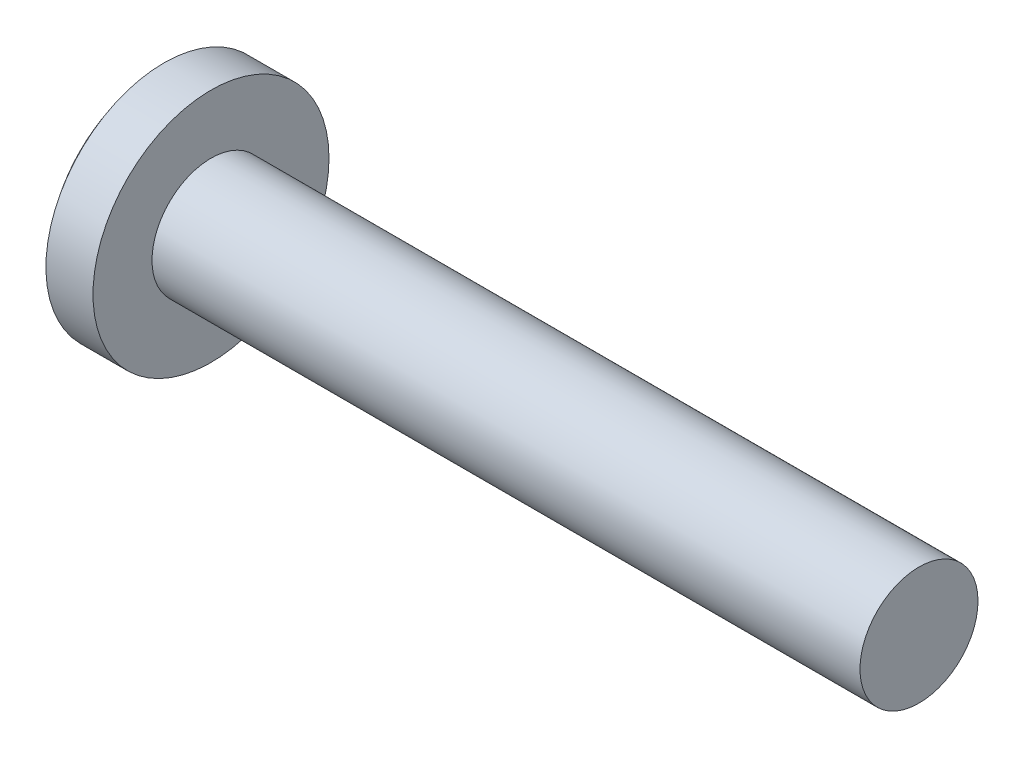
ISO-10303-21;
HEADER;
FILE_DESCRIPTION(('STEP AP214'),'2;1');
FILE_NAME('part.step','',(''),(''),'','','');
FILE_SCHEMA(('AUTOMOTIVE_DESIGN { 1 0 10303 214 1 1 1 1 }'));
ENDSEC;
DATA;
#1=APPLICATION_CONTEXT('core data for automotive mechanical design processes');
#2=APPLICATION_PROTOCOL_DEFINITION('international standard','automotive_design',2000,#1);
#3=PRODUCT_CONTEXT('',#1,'mechanical');
#4=PRODUCT('Part','Part','',(#3));
#5=PRODUCT_RELATED_PRODUCT_CATEGORY('part','',(#4));
#6=PRODUCT_DEFINITION_FORMATION('','',#4);
#7=PRODUCT_DEFINITION_CONTEXT('part definition',#1,'design');
#8=PRODUCT_DEFINITION('design','',#6,#7);
#9=PRODUCT_DEFINITION_SHAPE('','',#8);
#10=(LENGTH_UNIT() NAMED_UNIT(*) SI_UNIT(.MILLI.,.METRE.));
#11=(NAMED_UNIT(*) PLANE_ANGLE_UNIT() SI_UNIT($,.RADIAN.));
#12=(NAMED_UNIT(*) SI_UNIT($,.STERADIAN.) SOLID_ANGLE_UNIT());
#13=UNCERTAINTY_MEASURE_WITH_UNIT(LENGTH_MEASURE(1.E-05),#10,'distance_accuracy_value','');
#14=(GEOMETRIC_REPRESENTATION_CONTEXT(3) GLOBAL_UNCERTAINTY_ASSIGNED_CONTEXT((#13)) GLOBAL_UNIT_ASSIGNED_CONTEXT((#10,
#11,#12)) REPRESENTATION_CONTEXT('',''));
#15=CARTESIAN_POINT('',(0.,0.,0.));
#16=DIRECTION('',(0.,0.,1.));
#17=DIRECTION('',(1.,0.,0.));
#18=AXIS2_PLACEMENT_3D('',#15,#16,#17);
#19=CARTESIAN_POINT('',(16.,0.,0.));
#20=DIRECTION('',(1.,0.,0.));
#21=DIRECTION('',(0.,1.,0.));
#22=AXIS2_PLACEMENT_3D('',#19,#20,#21);
#23=SPHERICAL_SURFACE('',#22,16.);
#24=CARTESIAN_POINT('',(3.51000400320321,0.,0.));
#25=DIRECTION('',(1.,0.,0.));
#26=DIRECTION('',(0.,0.,-1.));
#27=AXIS2_PLACEMENT_3D('',#24,#25,#26);
#28=CIRCLE('',#27,10.);
#29=CARTESIAN_POINT('',(3.51000400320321,0.,-10.));
#30=VERTEX_POINT('',#29);
#31=EDGE_CURVE('E139',#30,#30,#28,.T.);
#32=ORIENTED_EDGE('',*,*,#31,.F.);
#33=EDGE_LOOP('',(#32));
#34=FACE_BOUND('',#33,.T.);
#35=CARTESIAN_POINT('',(16.,-1.01,0.));
#36=DIRECTION('',(0.,1.,0.));
#37=DIRECTION('',(0.,0.,1.));
#38=AXIS2_PLACEMENT_3D('',#35,#36,#37);
#39=CIRCLE('',#38,15.9680900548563);
#40=CARTESIAN_POINT('',(0.719312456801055,-1.01,4.63470475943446));
#41=VERTEX_POINT('',#40);
#42=CARTESIAN_POINT('',(0.0857359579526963,-1.01,1.31));
#43=VERTEX_POINT('',#42);
#44=EDGE_CURVE('E223',#41,#43,#39,.F.);
#45=ORIENTED_EDGE('',*,*,#44,.T.);
#46=CARTESIAN_POINT('',(0.0857359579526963,-1.01,1.31));
#47=CARTESIAN_POINT('',(0.0843523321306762,-1.009985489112,1.29320579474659));
#48=CARTESIAN_POINT('',(0.0830867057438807,-1.01140943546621,1.27640447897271));
#49=CARTESIAN_POINT('',(0.0808227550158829,-1.01703840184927,1.2432658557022));
#50=CARTESIAN_POINT('',(0.0798242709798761,-1.02124175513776,1.2269282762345));
#51=CARTESIAN_POINT('',(0.0781236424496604,-1.03233739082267,1.1951641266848));
#52=CARTESIAN_POINT('',(0.0774216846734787,-1.0392313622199,1.17973813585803));
#53=CARTESIAN_POINT('',(0.0763353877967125,-1.0555106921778,1.15025481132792));
#54=CARTESIAN_POINT('',(0.0759509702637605,-1.06489543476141,1.13619714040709));
#55=CARTESIAN_POINT('',(0.0755117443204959,-1.08585350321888,1.10989987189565));
#56=CARTESIAN_POINT('',(0.0754557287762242,-1.09741865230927,1.09765377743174));
#57=CARTESIAN_POINT('',(0.0756717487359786,-1.1224332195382,1.07526516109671));
#58=CARTESIAN_POINT('',(0.0759438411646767,-1.13588296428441,1.06512300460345));
#59=CARTESIAN_POINT('',(0.0768074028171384,-1.16425771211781,1.04724522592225));
#60=CARTESIAN_POINT('',(0.0773984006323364,-1.1791805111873,1.03950607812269));
#61=CARTESIAN_POINT('',(0.0788823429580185,-1.21009230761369,1.02663024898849));
#62=CARTESIAN_POINT('',(0.0797751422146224,-1.22608078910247,1.02149231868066));
#63=CARTESIAN_POINT('',(0.0815069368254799,-1.25346282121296,1.01515515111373));
#64=CARTESIAN_POINT('',(0.0822724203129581,-1.2646970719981,1.0132225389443));
#65=CARTESIAN_POINT('',(0.08391953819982,-1.28728760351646,1.01064499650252));
#66=CARTESIAN_POINT('',(0.084801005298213,-1.29864368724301,1.00999823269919));
#67=CARTESIAN_POINT('',(0.0857359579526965,-1.31,1.01));
#68=B_SPLINE_CURVE_WITH_KNOTS('',3,(#46,#47,#48,#49,#50,#51,#52,#53,#54,#55,#56,#57,#58,#59,#60,
#61,#62,#63,#64,#65,#66,#67),.UNSPECIFIED.,.F.,.F.,(4,2,2,2,2,2,2,2,2,2,4),(0.,
0.0504891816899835,0.100948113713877,0.151438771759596,0.20191695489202,0.252209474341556,
0.30251072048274,0.352737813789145,0.402940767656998,0.437146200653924,0.471302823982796),.UNSPECIFIED.);
#69=CARTESIAN_POINT('',(0.0857359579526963,-1.31,1.01));
#70=VERTEX_POINT('',#69);
#71=EDGE_CURVE('E226',#43,#70,#68,.T.);
#72=ORIENTED_EDGE('',*,*,#71,.T.);
#73=CARTESIAN_POINT('',(16.,0.,1.01));
#74=DIRECTION('',(0.,0.,-1.));
#75=DIRECTION('',(0.,1.,0.));
#76=AXIS2_PLACEMENT_3D('',#73,#74,#75);
#77=CIRCLE('',#76,15.9680900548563);
#78=CARTESIAN_POINT('',(0.719312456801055,-4.63470475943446,1.01));
#79=VERTEX_POINT('',#78);
#80=EDGE_CURVE('E235',#70,#79,#77,.F.);
#81=ORIENTED_EDGE('',*,*,#80,.T.);
#82=CARTESIAN_POINT('',(14.1867141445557,3.14070323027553,0.));
#83=DIRECTION('',(-0.500000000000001,0.866025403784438,0.));
#84=DIRECTION('',(-0.866025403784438,-0.500000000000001,0.));
#85=AXIS2_PLACEMENT_3D('',#82,#83,#84);
#86=CIRCLE('',#85,15.5835803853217);
#87=CARTESIAN_POINT('',(0.719312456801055,-4.63470475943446,-1.01));
#88=VERTEX_POINT('',#87);
#89=EDGE_CURVE('E238',#79,#88,#86,.F.);
#90=ORIENTED_EDGE('',*,*,#89,.T.);
#91=CARTESIAN_POINT('',(16.,0.,-1.01));
#92=DIRECTION('',(0.,0.,1.));
#93=DIRECTION('',(1.,0.,0.));
#94=AXIS2_PLACEMENT_3D('',#91,#92,#93);
#95=CIRCLE('',#94,15.9680900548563);
#96=CARTESIAN_POINT('',(0.0857359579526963,-1.31,-1.01));
#97=VERTEX_POINT('',#96);
#98=EDGE_CURVE('E244',#88,#97,#95,.F.);
#99=ORIENTED_EDGE('',*,*,#98,.T.);
#100=CARTESIAN_POINT('',(0.0857359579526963,-1.31,-1.01));
#101=CARTESIAN_POINT('',(0.0843523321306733,-1.29320579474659,-1.009985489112));
#102=CARTESIAN_POINT('',(0.083086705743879,-1.27640447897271,-1.01140943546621));
#103=CARTESIAN_POINT('',(0.0808227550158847,-1.2432658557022,-1.01703840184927));
#104=CARTESIAN_POINT('',(0.0798242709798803,-1.2269282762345,-1.02124175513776));
#105=CARTESIAN_POINT('',(0.0781236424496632,-1.1951641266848,-1.03233739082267));
#106=CARTESIAN_POINT('',(0.0774216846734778,-1.17973813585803,-1.0392313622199));
#107=CARTESIAN_POINT('',(0.0763353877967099,-1.15025481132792,-1.0555106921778));
#108=CARTESIAN_POINT('',(0.0759509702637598,-1.13619714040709,-1.06489543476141));
#109=CARTESIAN_POINT('',(0.0755117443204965,-1.10989987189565,-1.08585350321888));
#110=CARTESIAN_POINT('',(0.075455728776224,-1.09765377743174,-1.09741865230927));
#111=CARTESIAN_POINT('',(0.0756717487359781,-1.07526516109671,-1.1224332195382));
#112=CARTESIAN_POINT('',(0.0759438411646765,-1.06512300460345,-1.13588296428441));
#113=CARTESIAN_POINT('',(0.0768074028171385,-1.04724522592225,-1.16425771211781));
#114=CARTESIAN_POINT('',(0.0773984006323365,-1.03950607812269,-1.1791805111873));
#115=CARTESIAN_POINT('',(0.0788823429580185,-1.02663024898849,-1.21009230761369));
#116=CARTESIAN_POINT('',(0.0797751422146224,-1.02149231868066,-1.22608078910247));
#117=CARTESIAN_POINT('',(0.0815069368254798,-1.01515515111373,-1.25346282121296));
#118=CARTESIAN_POINT('',(0.0822724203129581,-1.0132225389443,-1.2646970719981));
#119=CARTESIAN_POINT('',(0.08391953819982,-1.01064499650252,-1.28728760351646));
#120=CARTESIAN_POINT('',(0.0848010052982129,-1.00999823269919,-1.29864368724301));
#121=CARTESIAN_POINT('',(0.0857359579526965,-1.01,-1.31));
#122=B_SPLINE_CURVE_WITH_KNOTS('',3,(#100,#101,#102,#103,#104,#105,#106,#107,#108,#109,#110,
#111,#112,#113,#114,#115,#116,#117,#118,#119,#120,#121),.UNSPECIFIED.,.F.,.F.,(4,2,2,2,2,2,2,2,
2,2,4),(0.,0.0504891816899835,0.100948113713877,0.151438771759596,0.20191695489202,
0.252209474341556,0.30251072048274,0.352737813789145,0.402940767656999,0.437146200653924,
0.471302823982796),.UNSPECIFIED.);
#123=CARTESIAN_POINT('',(0.0857359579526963,-1.01,-1.31));
#124=VERTEX_POINT('',#123);
#125=EDGE_CURVE('E345',#97,#124,#122,.T.);
#126=ORIENTED_EDGE('',*,*,#125,.T.);
#127=CARTESIAN_POINT('',(16.,-1.01,0.));
#128=DIRECTION('',(0.,1.,0.));
#129=DIRECTION('',(0.,0.,1.));
#130=AXIS2_PLACEMENT_3D('',#127,#128,#129);
#131=CIRCLE('',#130,15.9680900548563);
#132=CARTESIAN_POINT('',(0.719312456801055,-1.01,-4.63470475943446));
#133=VERTEX_POINT('',#132);
#134=EDGE_CURVE('E242',#124,#133,#131,.F.);
#135=ORIENTED_EDGE('',*,*,#134,.T.);
#136=CARTESIAN_POINT('',(14.1867141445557,0.,3.14070323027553));
#137=DIRECTION('',(-0.500000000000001,0.,0.866025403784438));
#138=DIRECTION('',(0.866025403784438,0.,0.500000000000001));
#139=AXIS2_PLACEMENT_3D('',#136,#137,#138);
#140=CIRCLE('',#139,15.5835803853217);
#141=CARTESIAN_POINT('',(0.719312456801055,1.01,-4.63470475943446));
#142=VERTEX_POINT('',#141);
#143=EDGE_CURVE('E245',#133,#142,#140,.F.);
#144=ORIENTED_EDGE('',*,*,#143,.T.);
#145=CARTESIAN_POINT('',(16.,1.01,0.));
#146=DIRECTION('',(0.,-1.,0.));
#147=DIRECTION('',(0.,0.,-1.));
#148=AXIS2_PLACEMENT_3D('',#145,#146,#147);
#149=CIRCLE('',#148,15.9680900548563);
#150=CARTESIAN_POINT('',(0.0857359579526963,1.01,-1.31));
#151=VERTEX_POINT('',#150);
#152=EDGE_CURVE('E246',#142,#151,#149,.F.);
#153=ORIENTED_EDGE('',*,*,#152,.T.);
#154=CARTESIAN_POINT('',(0.0857359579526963,1.01,-1.31));
#155=CARTESIAN_POINT('',(0.0843523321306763,1.009985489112,-1.29320579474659));
#156=CARTESIAN_POINT('',(0.0830867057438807,1.01140943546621,-1.27640447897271));
#157=CARTESIAN_POINT('',(0.0808227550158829,1.01703840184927,-1.2432658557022));
#158=CARTESIAN_POINT('',(0.0798242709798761,1.02124175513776,-1.2269282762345));
#159=CARTESIAN_POINT('',(0.0781236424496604,1.03233739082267,-1.1951641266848));
#160=CARTESIAN_POINT('',(0.0774216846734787,1.0392313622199,-1.17973813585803));
#161=CARTESIAN_POINT('',(0.0763353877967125,1.0555106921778,-1.15025481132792));
#162=CARTESIAN_POINT('',(0.0759509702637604,1.06489543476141,-1.13619714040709));
#163=CARTESIAN_POINT('',(0.0755117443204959,1.08585350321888,-1.10989987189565));
#164=CARTESIAN_POINT('',(0.0754557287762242,1.09741865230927,-1.09765377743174));
#165=CARTESIAN_POINT('',(0.0756717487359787,1.1224332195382,-1.07526516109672));
#166=CARTESIAN_POINT('',(0.0759438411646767,1.13588296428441,-1.06512300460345));
#167=CARTESIAN_POINT('',(0.0768074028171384,1.16425771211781,-1.04724522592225));
#168=CARTESIAN_POINT('',(0.0773984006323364,1.1791805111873,-1.03950607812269));
#169=CARTESIAN_POINT('',(0.0788823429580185,1.21009230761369,-1.02663024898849));
#170=CARTESIAN_POINT('',(0.0797751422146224,1.22608078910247,-1.02149231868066));
#171=CARTESIAN_POINT('',(0.0815069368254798,1.25346282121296,-1.01515515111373));
#172=CARTESIAN_POINT('',(0.0822724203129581,1.2646970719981,-1.0132225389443));
#173=CARTESIAN_POINT('',(0.08391953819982,1.28728760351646,-1.01064499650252));
#174=CARTESIAN_POINT('',(0.084801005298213,1.29864368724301,-1.00999823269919));
#175=CARTESIAN_POINT('',(0.0857359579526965,1.31,-1.01));
#176=B_SPLINE_CURVE_WITH_KNOTS('',3,(#154,#155,#156,#157,#158,#159,#160,#161,#162,#163,#164,
#165,#166,#167,#168,#169,#170,#171,#172,#173,#174,#175),.UNSPECIFIED.,.F.,.F.,(4,2,2,2,2,2,2,2,
2,2,4),(0.,0.0504891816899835,0.100948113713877,0.151438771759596,0.20191695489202,
0.252209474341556,0.30251072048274,0.352737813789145,0.402940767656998,0.437146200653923,
0.471302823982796),.UNSPECIFIED.);
#177=CARTESIAN_POINT('',(0.0857359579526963,1.31,-1.01));
#178=VERTEX_POINT('',#177);
#179=EDGE_CURVE('E157',#151,#178,#176,.T.);
#180=ORIENTED_EDGE('',*,*,#179,.T.);
#181=CARTESIAN_POINT('',(16.,0.,-1.01));
#182=DIRECTION('',(0.,0.,1.));
#183=DIRECTION('',(1.,0.,0.));
#184=AXIS2_PLACEMENT_3D('',#181,#182,#183);
#185=CIRCLE('',#184,15.9680900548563);
#186=CARTESIAN_POINT('',(0.719312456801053,4.63470475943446,-1.01));
#187=VERTEX_POINT('',#186);
#188=EDGE_CURVE('E248',#178,#187,#185,.F.);
#189=ORIENTED_EDGE('',*,*,#188,.T.);
#190=CARTESIAN_POINT('',(14.1867141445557,-3.14070323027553,0.));
#191=DIRECTION('',(-0.500000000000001,-0.866025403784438,0.));
#192=DIRECTION('',(0.866025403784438,-0.500000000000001,0.));
#193=AXIS2_PLACEMENT_3D('',#190,#191,#192);
#194=CIRCLE('',#193,15.5835803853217);
#195=CARTESIAN_POINT('',(0.719312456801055,4.63470475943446,1.01));
#196=VERTEX_POINT('',#195);
#197=EDGE_CURVE('E122',#187,#196,#194,.F.);
#198=ORIENTED_EDGE('',*,*,#197,.T.);
#199=CARTESIAN_POINT('',(16.,0.,1.01));
#200=DIRECTION('',(0.,0.,-1.));
#201=DIRECTION('',(0.,1.,0.));
#202=AXIS2_PLACEMENT_3D('',#199,#200,#201);
#203=CIRCLE('',#202,15.9680900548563);
#204=CARTESIAN_POINT('',(0.0857359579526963,1.31,1.01));
#205=VERTEX_POINT('',#204);
#206=EDGE_CURVE('E153',#196,#205,#203,.F.);
#207=ORIENTED_EDGE('',*,*,#206,.T.);
#208=CARTESIAN_POINT('',(0.0857359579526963,1.31,1.01));
#209=CARTESIAN_POINT('',(0.0843523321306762,1.29320579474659,1.009985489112));
#210=CARTESIAN_POINT('',(0.0830867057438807,1.27640447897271,1.01140943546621));
#211=CARTESIAN_POINT('',(0.0808227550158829,1.2432658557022,1.01703840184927));
#212=CARTESIAN_POINT('',(0.0798242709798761,1.2269282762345,1.02124175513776));
#213=CARTESIAN_POINT('',(0.0781236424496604,1.1951641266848,1.03233739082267));
#214=CARTESIAN_POINT('',(0.0774216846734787,1.17973813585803,1.0392313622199));
#215=CARTESIAN_POINT('',(0.0763353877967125,1.15025481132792,1.0555106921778));
#216=CARTESIAN_POINT('',(0.0759509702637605,1.13619714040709,1.06489543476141));
#217=CARTESIAN_POINT('',(0.075511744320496,1.10989987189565,1.08585350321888));
#218=CARTESIAN_POINT('',(0.0754557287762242,1.09765377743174,1.09741865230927));
#219=CARTESIAN_POINT('',(0.0756717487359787,1.07526516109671,1.1224332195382));
#220=CARTESIAN_POINT('',(0.0759438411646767,1.06512300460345,1.13588296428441));
#221=CARTESIAN_POINT('',(0.0768074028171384,1.04724522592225,1.16425771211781));
#222=CARTESIAN_POINT('',(0.0773984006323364,1.03950607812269,1.1791805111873));
#223=CARTESIAN_POINT('',(0.0788823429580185,1.02663024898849,1.21009230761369));
#224=CARTESIAN_POINT('',(0.0797751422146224,1.02149231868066,1.22608078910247));
#225=CARTESIAN_POINT('',(0.0815069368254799,1.01515515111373,1.25346282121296));
#226=CARTESIAN_POINT('',(0.0822724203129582,1.0132225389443,1.2646970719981));
#227=CARTESIAN_POINT('',(0.0839195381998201,1.01064499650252,1.28728760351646));
#228=CARTESIAN_POINT('',(0.084801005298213,1.00999823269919,1.29864368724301));
#229=CARTESIAN_POINT('',(0.0857359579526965,1.01,1.31));
#230=B_SPLINE_CURVE_WITH_KNOTS('',3,(#208,#209,#210,#211,#212,#213,#214,#215,#216,#217,#218,
#219,#220,#221,#222,#223,#224,#225,#226,#227,#228,#229),.UNSPECIFIED.,.F.,.F.,(4,2,2,2,2,2,2,2,
2,2,4),(0.,0.0504891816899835,0.100948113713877,0.151438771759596,0.20191695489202,
0.252209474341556,0.30251072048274,0.352737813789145,0.402940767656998,0.437146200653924,
0.471302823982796),.UNSPECIFIED.);
#231=CARTESIAN_POINT('',(0.0857359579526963,1.01,1.31));
#232=VERTEX_POINT('',#231);
#233=EDGE_CURVE('E167',#205,#232,#230,.T.);
#234=ORIENTED_EDGE('',*,*,#233,.T.);
#235=CARTESIAN_POINT('',(16.,1.01,0.));
#236=DIRECTION('',(0.,-1.,0.));
#237=DIRECTION('',(0.,0.,-1.));
#238=AXIS2_PLACEMENT_3D('',#235,#236,#237);
#239=CIRCLE('',#238,15.9680900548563);
#240=CARTESIAN_POINT('',(0.719312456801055,1.01,4.63470475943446));
#241=VERTEX_POINT('',#240);
#242=EDGE_CURVE('E158',#232,#241,#239,.F.);
#243=ORIENTED_EDGE('',*,*,#242,.T.);
#244=CARTESIAN_POINT('',(14.1867141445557,0.,-3.14070323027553));
#245=DIRECTION('',(-0.500000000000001,0.,-0.866025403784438));
#246=DIRECTION('',(-0.866025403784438,0.,0.500000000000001));
#247=AXIS2_PLACEMENT_3D('',#244,#245,#246);
#248=CIRCLE('',#247,15.5835803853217);
#249=EDGE_CURVE('E229',#241,#41,#248,.F.);
#250=ORIENTED_EDGE('',*,*,#249,.T.);
#251=EDGE_LOOP('',(#45,#72,#81,#90,#99,#126,#135,#144,#153,#180,#189,#198,#207,#234,#243,#250));
#252=FACE_BOUND('',#251,.T.);
#253=ADVANCED_FACE('F37',(#34,#252),#23,.T.);
#254=CARTESIAN_POINT('',(67.5,5.00000000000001,0.));
#255=DIRECTION('',(1.,0.,0.));
#256=DIRECTION('',(0.,0.,-1.));
#257=AXIS2_PLACEMENT_3D('',#254,#255,#256);
#258=PLANE('',#257);
#259=CARTESIAN_POINT('',(67.5,0.,0.));
#260=DIRECTION('',(1.,0.,0.));
#261=DIRECTION('',(0.,0.,-1.));
#262=AXIS2_PLACEMENT_3D('',#259,#260,#261);
#263=CIRCLE('',#262,5.00000000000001);
#264=CARTESIAN_POINT('',(67.5,0.,-5.00000000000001));
#265=VERTEX_POINT('',#264);
#266=EDGE_CURVE('E150',#265,#265,#263,.T.);
#267=ORIENTED_EDGE('',*,*,#266,.T.);
#268=EDGE_LOOP('',(#267));
#269=FACE_BOUND('',#268,.T.);
#270=ADVANCED_FACE('F209',(#269),#258,.T.);
#271=CARTESIAN_POINT('',(4.51581291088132,0.,0.));
#272=DIRECTION('',(1.,0.,0.));
#273=DIRECTION('',(0.,0.,-1.));
#274=AXIS2_PLACEMENT_3D('',#271,#272,#273);
#275=CYLINDRICAL_SURFACE('',#274,5.);
#276=CARTESIAN_POINT('',(7.50000000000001,0.,0.));
#277=DIRECTION('',(1.,0.,0.));
#278=DIRECTION('',(0.,0.,-1.));
#279=AXIS2_PLACEMENT_3D('',#276,#277,#278);
#280=CIRCLE('',#279,5.);
#281=CARTESIAN_POINT('',(7.50000000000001,0.,-5.));
#282=VERTEX_POINT('',#281);
#283=EDGE_CURVE('E147',#282,#282,#280,.T.);
#284=ORIENTED_EDGE('',*,*,#283,.T.);
#285=EDGE_LOOP('',(#284));
#286=FACE_BOUND('',#285,.T.);
#287=ORIENTED_EDGE('',*,*,#266,.F.);
#288=EDGE_LOOP('',(#287));
#289=FACE_BOUND('',#288,.T.);
#290=ADVANCED_FACE('F214',(#286,#289),#275,.T.);
#291=CARTESIAN_POINT('',(7.50000000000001,5.6,0.));
#292=DIRECTION('',(1.,0.,0.));
#293=DIRECTION('',(0.,0.,-1.));
#294=AXIS2_PLACEMENT_3D('',#291,#292,#293);
#295=PLANE('',#294);
#296=CARTESIAN_POINT('',(7.50000000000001,0.,0.));
#297=DIRECTION('',(1.,0.,0.));
#298=DIRECTION('',(0.,0.,-1.));
#299=AXIS2_PLACEMENT_3D('',#296,#297,#298);
#300=CIRCLE('',#299,10.);
#301=CARTESIAN_POINT('',(7.50000000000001,0.,-10.));
#302=VERTEX_POINT('',#301);
#303=EDGE_CURVE('E142',#302,#302,#300,.T.);
#304=ORIENTED_EDGE('',*,*,#303,.T.);
#305=EDGE_LOOP('',(#304));
#306=FACE_BOUND('',#305,.T.);
#307=ORIENTED_EDGE('',*,*,#283,.F.);
#308=EDGE_LOOP('',(#307));
#309=FACE_BOUND('',#308,.T.);
#310=ADVANCED_FACE('F413',(#306,#309),#295,.T.);
#311=CARTESIAN_POINT('',(4.51581291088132,0.,0.));
#312=DIRECTION('',(1.,0.,0.));
#313=DIRECTION('',(0.,0.,-1.));
#314=AXIS2_PLACEMENT_3D('',#311,#312,#313);
#315=CYLINDRICAL_SURFACE('',#314,10.);
#316=ORIENTED_EDGE('',*,*,#31,.T.);
#317=EDGE_LOOP('',(#316));
#318=FACE_BOUND('',#317,.T.);
#319=ORIENTED_EDGE('',*,*,#303,.F.);
#320=EDGE_LOOP('',(#319));
#321=FACE_BOUND('',#320,.T.);
#322=ADVANCED_FACE('F409',(#318,#321),#315,.T.);
#323=CARTESIAN_POINT('',(1.3,1.01,1.01));
#324=DIRECTION('',(0.,-1.,0.));
#325=DIRECTION('',(0.,0.,-1.));
#326=AXIS2_PLACEMENT_3D('',#323,#324,#325);
#327=PLANE('',#326);
#328=ORIENTED_EDGE('',*,*,#242,.F.);
#329=DIRECTION('',(-1.,0.,0.));
#330=VECTOR('',#329,1.);
#331=CARTESIAN_POINT('',(1.3,1.01,1.31));
#332=LINE('',#331,#330);
#333=CARTESIAN_POINT('',(1.3,1.01,1.31));
#334=VERTEX_POINT('',#333);
#335=EDGE_CURVE('E299',#232,#334,#332,.F.);
#336=ORIENTED_EDGE('',*,*,#335,.T.);
#337=DIRECTION('',(0.,0.,1.));
#338=VECTOR('',#337,1.);
#339=CARTESIAN_POINT('',(1.3,1.01,1.01));
#340=LINE('',#339,#338);
#341=CARTESIAN_POINT('',(1.3,1.01,4.29944465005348));
#342=VERTEX_POINT('',#341);
#343=EDGE_CURVE('E263',#334,#342,#340,.T.);
#344=ORIENTED_EDGE('',*,*,#343,.T.);
#345=DIRECTION('',(-0.866025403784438,0.,0.500000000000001));
#346=VECTOR('',#345,1.);
#347=CARTESIAN_POINT('',(0.,1.01,5.05));
#348=LINE('',#347,#346);
#349=EDGE_CURVE('E143',#342,#241,#348,.T.);
#350=ORIENTED_EDGE('',*,*,#349,.T.);
#351=EDGE_LOOP('',(#328,#336,#344,#350));
#352=FACE_BOUND('',#351,.T.);
#353=ADVANCED_FACE('F189',(#352),#327,.T.);
#354=CARTESIAN_POINT('',(0.,0.,5.05));
#355=DIRECTION('',(-0.500000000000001,0.,-0.866025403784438));
#356=DIRECTION('',(-0.866025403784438,0.,0.500000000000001));
#357=AXIS2_PLACEMENT_3D('',#354,#355,#356);
#358=PLANE('',#357);
#359=ORIENTED_EDGE('',*,*,#349,.F.);
#360=DIRECTION('',(0.,-1.,0.));
#361=VECTOR('',#360,1.);
#362=CARTESIAN_POINT('',(1.3,0.,4.29944465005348));
#363=LINE('',#362,#361);
#364=CARTESIAN_POINT('',(1.3,-1.01,4.29944465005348));
#365=VERTEX_POINT('',#364);
#366=EDGE_CURVE('E260',#342,#365,#363,.T.);
#367=ORIENTED_EDGE('',*,*,#366,.T.);
#368=DIRECTION('',(-0.866025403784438,0.,0.500000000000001));
#369=VECTOR('',#368,1.);
#370=CARTESIAN_POINT('',(2.72437131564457,-1.01,3.47708348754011));
#371=LINE('',#370,#369);
#372=EDGE_CURVE('E256',#365,#41,#371,.T.);
#373=ORIENTED_EDGE('',*,*,#372,.T.);
#374=ORIENTED_EDGE('',*,*,#249,.F.);
#375=EDGE_LOOP('',(#359,#367,#373,#374));
#376=FACE_BOUND('',#375,.T.);
#377=ADVANCED_FACE('F185',(#376),#358,.T.);
#378=CARTESIAN_POINT('',(1.3,-1.01,1.01));
#379=DIRECTION('',(0.,1.,0.));
#380=DIRECTION('',(0.,0.,1.));
#381=AXIS2_PLACEMENT_3D('',#378,#379,#380);
#382=PLANE('',#381);
#383=DIRECTION('',(0.,0.,-1.));
#384=VECTOR('',#383,1.);
#385=CARTESIAN_POINT('',(1.3,-1.01,1.01));
#386=LINE('',#385,#384);
#387=CARTESIAN_POINT('',(1.3,-1.01,1.31));
#388=VERTEX_POINT('',#387);
#389=EDGE_CURVE('E262',#365,#388,#386,.T.);
#390=ORIENTED_EDGE('',*,*,#389,.T.);
#391=DIRECTION('',(-1.,0.,0.));
#392=VECTOR('',#391,1.);
#393=CARTESIAN_POINT('',(1.3,-1.01,1.31));
#394=LINE('',#393,#392);
#395=EDGE_CURVE('E154',#388,#43,#394,.T.);
#396=ORIENTED_EDGE('',*,*,#395,.T.);
#397=ORIENTED_EDGE('',*,*,#44,.F.);
#398=ORIENTED_EDGE('',*,*,#372,.F.);
#399=EDGE_LOOP('',(#390,#396,#397,#398));
#400=FACE_BOUND('',#399,.T.);
#401=ADVANCED_FACE('F188',(#400),#382,.T.);
#402=CARTESIAN_POINT('',(1.3,-1.01,1.01));
#403=DIRECTION('',(0.,0.,-1.));
#404=DIRECTION('',(0.,1.,0.));
#405=AXIS2_PLACEMENT_3D('',#402,#403,#404);
#406=PLANE('',#405);
#407=ORIENTED_EDGE('',*,*,#80,.F.);
#408=DIRECTION('',(-1.,0.,0.));
#409=VECTOR('',#408,1.);
#410=CARTESIAN_POINT('',(1.3,-1.31,1.01));
#411=LINE('',#410,#409);
#412=CARTESIAN_POINT('',(1.3,-1.31,1.01));
#413=VERTEX_POINT('',#412);
#414=EDGE_CURVE('E344',#70,#413,#411,.F.);
#415=ORIENTED_EDGE('',*,*,#414,.T.);
#416=DIRECTION('',(0.,-1.,0.));
#417=VECTOR('',#416,1.);
#418=CARTESIAN_POINT('',(1.3,-1.01,1.01));
#419=LINE('',#418,#417);
#420=CARTESIAN_POINT('',(1.3,-4.29944465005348,1.01));
#421=VERTEX_POINT('',#420);
#422=EDGE_CURVE('E283',#413,#421,#419,.T.);
#423=ORIENTED_EDGE('',*,*,#422,.T.);
#424=DIRECTION('',(-0.866025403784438,-0.500000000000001,0.));
#425=VECTOR('',#424,1.);
#426=CARTESIAN_POINT('',(0.,-5.05,1.01));
#427=LINE('',#426,#425);
#428=EDGE_CURVE('E259',#421,#79,#427,.T.);
#429=ORIENTED_EDGE('',*,*,#428,.T.);
#430=EDGE_LOOP('',(#407,#415,#423,#429));
#431=FACE_BOUND('',#430,.T.);
#432=ADVANCED_FACE('F196',(#431),#406,.T.);
#433=CARTESIAN_POINT('',(0.,-5.05,0.));
#434=DIRECTION('',(-0.500000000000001,0.866025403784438,0.));
#435=DIRECTION('',(-0.866025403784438,-0.500000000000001,0.));
#436=AXIS2_PLACEMENT_3D('',#433,#434,#435);
#437=PLANE('',#436);
#438=ORIENTED_EDGE('',*,*,#428,.F.);
#439=DIRECTION('',(0.,0.,-1.));
#440=VECTOR('',#439,1.);
#441=CARTESIAN_POINT('',(1.3,-4.29944465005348,0.));
#442=LINE('',#441,#440);
#443=CARTESIAN_POINT('',(1.3,-4.29944465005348,-1.01));
#444=VERTEX_POINT('',#443);
#445=EDGE_CURVE('E281',#421,#444,#442,.T.);
#446=ORIENTED_EDGE('',*,*,#445,.T.);
#447=DIRECTION('',(-0.866025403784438,-0.500000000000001,0.));
#448=VECTOR('',#447,1.);
#449=CARTESIAN_POINT('',(2.72437131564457,-3.47708348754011,-1.01));
#450=LINE('',#449,#448);
#451=EDGE_CURVE('E267',#444,#88,#450,.T.);
#452=ORIENTED_EDGE('',*,*,#451,.T.);
#453=ORIENTED_EDGE('',*,*,#89,.F.);
#454=EDGE_LOOP('',(#438,#446,#452,#453));
#455=FACE_BOUND('',#454,.T.);
#456=ADVANCED_FACE('F193',(#455),#437,.T.);
#457=CARTESIAN_POINT('',(1.3,-1.01,-1.01));
#458=DIRECTION('',(0.,0.,1.));
#459=DIRECTION('',(1.,0.,0.));
#460=AXIS2_PLACEMENT_3D('',#457,#458,#459);
#461=PLANE('',#460);
#462=DIRECTION('',(0.,1.,0.));
#463=VECTOR('',#462,1.);
#464=CARTESIAN_POINT('',(1.3,-1.01,-1.01));
#465=LINE('',#464,#463);
#466=CARTESIAN_POINT('',(1.3,-1.31,-1.01));
#467=VERTEX_POINT('',#466);
#468=EDGE_CURVE('E282',#444,#467,#465,.T.);
#469=ORIENTED_EDGE('',*,*,#468,.T.);
#470=DIRECTION('',(-1.,0.,0.));
#471=VECTOR('',#470,1.);
#472=CARTESIAN_POINT('',(1.3,-1.31,-1.01));
#473=LINE('',#472,#471);
#474=EDGE_CURVE('E347',#467,#97,#473,.T.);
#475=ORIENTED_EDGE('',*,*,#474,.T.);
#476=ORIENTED_EDGE('',*,*,#98,.F.);
#477=ORIENTED_EDGE('',*,*,#451,.F.);
#478=EDGE_LOOP('',(#469,#475,#476,#477));
#479=FACE_BOUND('',#478,.T.);
#480=ADVANCED_FACE('F195',(#479),#461,.T.);
#481=CARTESIAN_POINT('',(1.3,-1.01,-1.01));
#482=DIRECTION('',(0.,1.,0.));
#483=DIRECTION('',(0.,0.,1.));
#484=AXIS2_PLACEMENT_3D('',#481,#482,#483);
#485=PLANE('',#484);
#486=ORIENTED_EDGE('',*,*,#134,.F.);
#487=DIRECTION('',(-1.,0.,0.));
#488=VECTOR('',#487,1.);
#489=CARTESIAN_POINT('',(1.3,-1.01,-1.31));
#490=LINE('',#489,#488);
#491=CARTESIAN_POINT('',(1.3,-1.01,-1.31));
#492=VERTEX_POINT('',#491);
#493=EDGE_CURVE('E372',#124,#492,#490,.F.);
#494=ORIENTED_EDGE('',*,*,#493,.T.);
#495=DIRECTION('',(0.,0.,-1.));
#496=VECTOR('',#495,1.);
#497=CARTESIAN_POINT('',(1.3,-1.01,-1.01));
#498=LINE('',#497,#496);
#499=CARTESIAN_POINT('',(1.3,-1.01,-4.29944465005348));
#500=VERTEX_POINT('',#499);
#501=EDGE_CURVE('E274',#492,#500,#498,.T.);
#502=ORIENTED_EDGE('',*,*,#501,.T.);
#503=DIRECTION('',(-0.866025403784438,0.,-0.500000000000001));
#504=VECTOR('',#503,1.);
#505=CARTESIAN_POINT('',(0.,-1.01,-5.05));
#506=LINE('',#505,#504);
#507=EDGE_CURVE('E264',#500,#133,#506,.T.);
#508=ORIENTED_EDGE('',*,*,#507,.T.);
#509=EDGE_LOOP('',(#486,#494,#502,#508));
#510=FACE_BOUND('',#509,.T.);
#511=ADVANCED_FACE('F202',(#510),#485,.T.);
#512=CARTESIAN_POINT('',(0.,0.,-5.05));
#513=DIRECTION('',(-0.500000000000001,0.,0.866025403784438));
#514=DIRECTION('',(0.866025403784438,0.,0.500000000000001));
#515=AXIS2_PLACEMENT_3D('',#512,#513,#514);
#516=PLANE('',#515);
#517=ORIENTED_EDGE('',*,*,#507,.F.);
#518=DIRECTION('',(0.,1.,0.));
#519=VECTOR('',#518,1.);
#520=CARTESIAN_POINT('',(1.3,0.,-4.29944465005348));
#521=LINE('',#520,#519);
#522=CARTESIAN_POINT('',(1.3,1.01,-4.29944465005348));
#523=VERTEX_POINT('',#522);
#524=EDGE_CURVE('E272',#500,#523,#521,.T.);
#525=ORIENTED_EDGE('',*,*,#524,.T.);
#526=DIRECTION('',(-0.866025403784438,0.,-0.500000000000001));
#527=VECTOR('',#526,1.);
#528=CARTESIAN_POINT('',(2.72437131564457,1.01,-3.47708348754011));
#529=LINE('',#528,#527);
#530=EDGE_CURVE('E123',#523,#142,#529,.T.);
#531=ORIENTED_EDGE('',*,*,#530,.T.);
#532=ORIENTED_EDGE('',*,*,#143,.F.);
#533=EDGE_LOOP('',(#517,#525,#531,#532));
#534=FACE_BOUND('',#533,.T.);
#535=ADVANCED_FACE('F39',(#534),#516,.T.);
#536=CARTESIAN_POINT('',(1.3,1.01,-1.01));
#537=DIRECTION('',(0.,-1.,0.));
#538=DIRECTION('',(0.,0.,-1.));
#539=AXIS2_PLACEMENT_3D('',#536,#537,#538);
#540=PLANE('',#539);
#541=DIRECTION('',(0.,0.,1.));
#542=VECTOR('',#541,1.);
#543=CARTESIAN_POINT('',(1.3,1.01,-1.01));
#544=LINE('',#543,#542);
#545=CARTESIAN_POINT('',(1.3,1.01,-1.31));
#546=VERTEX_POINT('',#545);
#547=EDGE_CURVE('E117',#523,#546,#544,.T.);
#548=ORIENTED_EDGE('',*,*,#547,.T.);
#549=DIRECTION('',(-1.,0.,0.));
#550=VECTOR('',#549,1.);
#551=CARTESIAN_POINT('',(1.3,1.01,-1.31));
#552=LINE('',#551,#550);
#553=EDGE_CURVE('E294',#546,#151,#552,.T.);
#554=ORIENTED_EDGE('',*,*,#553,.T.);
#555=ORIENTED_EDGE('',*,*,#152,.F.);
#556=ORIENTED_EDGE('',*,*,#530,.F.);
#557=EDGE_LOOP('',(#548,#554,#555,#556));
#558=FACE_BOUND('',#557,.T.);
#559=ADVANCED_FACE('F386',(#558),#540,.T.);
#560=CARTESIAN_POINT('',(1.3,1.01,-1.01));
#561=DIRECTION('',(0.,0.,1.));
#562=DIRECTION('',(1.,0.,0.));
#563=AXIS2_PLACEMENT_3D('',#560,#561,#562);
#564=PLANE('',#563);
#565=ORIENTED_EDGE('',*,*,#188,.F.);
#566=DIRECTION('',(-1.,0.,0.));
#567=VECTOR('',#566,1.);
#568=CARTESIAN_POINT('',(1.3,1.31,-1.01));
#569=LINE('',#568,#567);
#570=CARTESIAN_POINT('',(1.3,1.31,-1.01));
#571=VERTEX_POINT('',#570);
#572=EDGE_CURVE('E56',#178,#571,#569,.F.);
#573=ORIENTED_EDGE('',*,*,#572,.T.);
#574=DIRECTION('',(0.,1.,0.));
#575=VECTOR('',#574,1.);
#576=CARTESIAN_POINT('',(1.3,1.01,-1.01));
#577=LINE('',#576,#575);
#578=CARTESIAN_POINT('',(1.3,4.29944465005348,-1.01));
#579=VERTEX_POINT('',#578);
#580=EDGE_CURVE('E112',#571,#579,#577,.T.);
#581=ORIENTED_EDGE('',*,*,#580,.T.);
#582=DIRECTION('',(-0.866025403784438,0.500000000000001,0.));
#583=VECTOR('',#582,1.);
#584=CARTESIAN_POINT('',(0.,5.05,-1.01));
#585=LINE('',#584,#583);
#586=EDGE_CURVE('E114',#579,#187,#585,.T.);
#587=ORIENTED_EDGE('',*,*,#586,.T.);
#588=EDGE_LOOP('',(#565,#573,#581,#587));
#589=FACE_BOUND('',#588,.T.);
#590=ADVANCED_FACE('F113',(#589),#564,.T.);
#591=CARTESIAN_POINT('',(0.,5.05,0.));
#592=DIRECTION('',(-0.500000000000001,-0.866025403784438,0.));
#593=DIRECTION('',(0.866025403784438,-0.500000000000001,0.));
#594=AXIS2_PLACEMENT_3D('',#591,#592,#593);
#595=PLANE('',#594);
#596=ORIENTED_EDGE('',*,*,#586,.F.);
#597=DIRECTION('',(0.,0.,1.));
#598=VECTOR('',#597,1.);
#599=CARTESIAN_POINT('',(1.3,4.29944465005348,0.));
#600=LINE('',#599,#598);
#601=CARTESIAN_POINT('',(1.3,4.29944465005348,1.01));
#602=VERTEX_POINT('',#601);
#603=EDGE_CURVE('E41',#579,#602,#600,.T.);
#604=ORIENTED_EDGE('',*,*,#603,.T.);
#605=DIRECTION('',(-0.866025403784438,0.500000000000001,0.));
#606=VECTOR('',#605,1.);
#607=CARTESIAN_POINT('',(2.72437131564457,3.47708348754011,1.01));
#608=LINE('',#607,#606);
#609=EDGE_CURVE('E124',#602,#196,#608,.T.);
#610=ORIENTED_EDGE('',*,*,#609,.T.);
#611=ORIENTED_EDGE('',*,*,#197,.F.);
#612=EDGE_LOOP('',(#596,#604,#610,#611));
#613=FACE_BOUND('',#612,.T.);
#614=ADVANCED_FACE('F120',(#613),#595,.T.);
#615=CARTESIAN_POINT('',(1.3,1.01,1.01));
#616=DIRECTION('',(0.,0.,-1.));
#617=DIRECTION('',(0.,1.,0.));
#618=AXIS2_PLACEMENT_3D('',#615,#616,#617);
#619=PLANE('',#618);
#620=DIRECTION('',(0.,-1.,0.));
#621=VECTOR('',#620,1.);
#622=CARTESIAN_POINT('',(1.3,1.01,1.01));
#623=LINE('',#622,#621);
#624=CARTESIAN_POINT('',(1.3,1.31,1.01));
#625=VERTEX_POINT('',#624);
#626=EDGE_CURVE('E131',#602,#625,#623,.T.);
#627=ORIENTED_EDGE('',*,*,#626,.T.);
#628=DIRECTION('',(-1.,0.,0.));
#629=VECTOR('',#628,1.);
#630=CARTESIAN_POINT('',(1.3,1.31,1.01));
#631=LINE('',#630,#629);
#632=EDGE_CURVE('E314',#625,#205,#631,.T.);
#633=ORIENTED_EDGE('',*,*,#632,.T.);
#634=ORIENTED_EDGE('',*,*,#206,.F.);
#635=ORIENTED_EDGE('',*,*,#609,.F.);
#636=EDGE_LOOP('',(#627,#633,#634,#635));
#637=FACE_BOUND('',#636,.T.);
#638=ADVANCED_FACE('F192',(#637),#619,.T.);
#639=CARTESIAN_POINT('',(1.3,1.01,1.01));
#640=DIRECTION('',(1.,0.,0.));
#641=DIRECTION('',(0.,0.,-1.));
#642=AXIS2_PLACEMENT_3D('',#639,#640,#641);
#643=PLANE('',#642);
#644=ORIENTED_EDGE('',*,*,#343,.F.);
#645=CARTESIAN_POINT('',(1.3,1.31,1.31));
#646=DIRECTION('',(1.,0.,0.));
#647=DIRECTION('',(0.,0.,-1.));
#648=AXIS2_PLACEMENT_3D('',#645,#646,#647);
#649=CIRCLE('',#648,0.3);
#650=EDGE_CURVE('E47',#334,#625,#649,.T.);
#651=ORIENTED_EDGE('',*,*,#650,.T.);
#652=ORIENTED_EDGE('',*,*,#626,.F.);
#653=ORIENTED_EDGE('',*,*,#603,.F.);
#654=ORIENTED_EDGE('',*,*,#580,.F.);
#655=CARTESIAN_POINT('',(1.3,1.31,-1.31));
#656=DIRECTION('',(1.,0.,0.));
#657=DIRECTION('',(0.,0.,-1.));
#658=AXIS2_PLACEMENT_3D('',#655,#656,#657);
#659=CIRCLE('',#658,0.3);
#660=EDGE_CURVE('E11',#571,#546,#659,.T.);
#661=ORIENTED_EDGE('',*,*,#660,.T.);
#662=ORIENTED_EDGE('',*,*,#547,.F.);
#663=ORIENTED_EDGE('',*,*,#524,.F.);
#664=ORIENTED_EDGE('',*,*,#501,.F.);
#665=CARTESIAN_POINT('',(1.3,-1.31,-1.31));
#666=DIRECTION('',(1.,0.,0.));
#667=DIRECTION('',(0.,0.,-1.));
#668=AXIS2_PLACEMENT_3D('',#665,#666,#667);
#669=CIRCLE('',#668,0.3);
#670=EDGE_CURVE('E297',#492,#467,#669,.T.);
#671=ORIENTED_EDGE('',*,*,#670,.T.);
#672=ORIENTED_EDGE('',*,*,#468,.F.);
#673=ORIENTED_EDGE('',*,*,#445,.F.);
#674=ORIENTED_EDGE('',*,*,#422,.F.);
#675=CARTESIAN_POINT('',(1.3,-1.31,1.31));
#676=DIRECTION('',(1.,0.,0.));
#677=DIRECTION('',(0.,0.,-1.));
#678=AXIS2_PLACEMENT_3D('',#675,#676,#677);
#679=CIRCLE('',#678,0.3);
#680=EDGE_CURVE('E293',#413,#388,#679,.T.);
#681=ORIENTED_EDGE('',*,*,#680,.T.);
#682=ORIENTED_EDGE('',*,*,#389,.F.);
#683=ORIENTED_EDGE('',*,*,#366,.F.);
#684=EDGE_LOOP('',(#644,#651,#652,#653,#654,#661,#662,#663,#664,#671,#672,#673,#674,#681,#682,#683));
#685=FACE_BOUND('',#684,.T.);
#686=ADVANCED_FACE('F128',(#685),#643,.F.);
#687=CARTESIAN_POINT('',(1.3,-1.31,1.31));
#688=DIRECTION('',(-1.,0.,0.));
#689=DIRECTION('',(0.,0.,1.));
#690=AXIS2_PLACEMENT_3D('',#687,#688,#689);
#691=CYLINDRICAL_SURFACE('',#690,0.3);
#692=ORIENTED_EDGE('',*,*,#680,.F.);
#693=ORIENTED_EDGE('',*,*,#414,.F.);
#694=ORIENTED_EDGE('',*,*,#71,.F.);
#695=ORIENTED_EDGE('',*,*,#395,.F.);
#696=EDGE_LOOP('',(#692,#693,#694,#695));
#697=FACE_BOUND('',#696,.T.);
#698=ADVANCED_FACE('F343',(#697),#691,.T.);
#699=CARTESIAN_POINT('',(1.3,-1.31,-1.31));
#700=DIRECTION('',(-1.,0.,0.));
#701=DIRECTION('',(0.,0.,1.));
#702=AXIS2_PLACEMENT_3D('',#699,#700,#701);
#703=CYLINDRICAL_SURFACE('',#702,0.3);
#704=ORIENTED_EDGE('',*,*,#670,.F.);
#705=ORIENTED_EDGE('',*,*,#493,.F.);
#706=ORIENTED_EDGE('',*,*,#125,.F.);
#707=ORIENTED_EDGE('',*,*,#474,.F.);
#708=EDGE_LOOP('',(#704,#705,#706,#707));
#709=FACE_BOUND('',#708,.T.);
#710=ADVANCED_FACE('F361',(#709),#703,.T.);
#711=CARTESIAN_POINT('',(1.3,1.31,1.31));
#712=DIRECTION('',(-1.,0.,0.));
#713=DIRECTION('',(0.,0.,1.));
#714=AXIS2_PLACEMENT_3D('',#711,#712,#713);
#715=CYLINDRICAL_SURFACE('',#714,0.3);
#716=ORIENTED_EDGE('',*,*,#650,.F.);
#717=ORIENTED_EDGE('',*,*,#335,.F.);
#718=ORIENTED_EDGE('',*,*,#233,.F.);
#719=ORIENTED_EDGE('',*,*,#632,.F.);
#720=EDGE_LOOP('',(#716,#717,#718,#719));
#721=FACE_BOUND('',#720,.T.);
#722=ADVANCED_FACE('F181',(#721),#715,.T.);
#723=CARTESIAN_POINT('',(1.3,1.31,-1.31));
#724=DIRECTION('',(-1.,0.,0.));
#725=DIRECTION('',(0.,0.,1.));
#726=AXIS2_PLACEMENT_3D('',#723,#724,#725);
#727=CYLINDRICAL_SURFACE('',#726,0.3);
#728=ORIENTED_EDGE('',*,*,#660,.F.);
#729=ORIENTED_EDGE('',*,*,#572,.F.);
#730=ORIENTED_EDGE('',*,*,#179,.F.);
#731=ORIENTED_EDGE('',*,*,#553,.F.);
#732=EDGE_LOOP('',(#728,#729,#730,#731));
#733=FACE_BOUND('',#732,.T.);
#734=ADVANCED_FACE('F177',(#733),#727,.T.);
#735=CLOSED_SHELL('',(#253,#270,#290,#310,#322,#353,#377,#401,#432,#456,#480,#511,#535,#559,
#590,#614,#638,#686,#698,#710,#722,#734));
#736=MANIFOLD_SOLID_BREP('B2',#735);
#737=ADVANCED_BREP_SHAPE_REPRESENTATION('',(#18,#736),#14);
#738=SHAPE_DEFINITION_REPRESENTATION(#9,#737);
ENDSEC;
END-ISO-10303-21;
